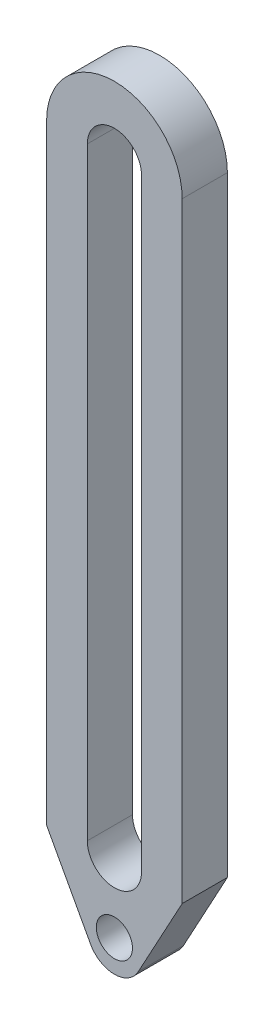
ISO-10303-21;
HEADER;
FILE_DESCRIPTION(('STEP AP214'),'2;1');
FILE_NAME('part.step','',(''),(''),'','','');
FILE_SCHEMA(('AUTOMOTIVE_DESIGN { 1 0 10303 214 1 1 1 1 }'));
ENDSEC;
DATA;
#1=APPLICATION_CONTEXT('core data for automotive mechanical design processes');
#2=APPLICATION_PROTOCOL_DEFINITION('international standard','automotive_design',2000,#1);
#3=PRODUCT_CONTEXT('',#1,'mechanical');
#4=PRODUCT('Part','Part','',(#3));
#5=PRODUCT_RELATED_PRODUCT_CATEGORY('part','',(#4));
#6=PRODUCT_DEFINITION_FORMATION('','',#4);
#7=PRODUCT_DEFINITION_CONTEXT('part definition',#1,'design');
#8=PRODUCT_DEFINITION('design','',#6,#7);
#9=PRODUCT_DEFINITION_SHAPE('','',#8);
#10=(LENGTH_UNIT() NAMED_UNIT(*) SI_UNIT(.MILLI.,.METRE.));
#11=(NAMED_UNIT(*) PLANE_ANGLE_UNIT() SI_UNIT($,.RADIAN.));
#12=(NAMED_UNIT(*) SI_UNIT($,.STERADIAN.) SOLID_ANGLE_UNIT());
#13=UNCERTAINTY_MEASURE_WITH_UNIT(LENGTH_MEASURE(1.E-05),#10,'distance_accuracy_value','');
#14=(GEOMETRIC_REPRESENTATION_CONTEXT(3) GLOBAL_UNCERTAINTY_ASSIGNED_CONTEXT((#13)) GLOBAL_UNIT_ASSIGNED_CONTEXT((#10,
#11,#12)) REPRESENTATION_CONTEXT('',''));
#15=CARTESIAN_POINT('',(0.,0.,0.));
#16=DIRECTION('',(0.,0.,1.));
#17=DIRECTION('',(1.,0.,0.));
#18=AXIS2_PLACEMENT_3D('',#15,#16,#17);
#19=CARTESIAN_POINT('',(-9.09802711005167,-17.1856502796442,5.));
#20=DIRECTION('',(0.,0.,-1.));
#21=DIRECTION('',(-1.,0.,0.));
#22=AXIS2_PLACEMENT_3D('',#19,#20,#21);
#23=PLANE('',#22);
#24=DIRECTION('',(0.477072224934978,0.878864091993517,0.));
#25=VECTOR('',#24,1.);
#26=CARTESIAN_POINT('',(-1.59802711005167,-9.65748053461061,5.));
#27=LINE('',#26,#25);
#28=CARTESIAN_POINT('',(-6.46143483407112,-18.6168669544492,5.));
#29=VERTEX_POINT('',#28);
#30=CARTESIAN_POINT('',(-1.59802711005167,-9.65748053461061,5.));
#31=VERTEX_POINT('',#30);
#32=EDGE_CURVE('E150',#29,#31,#27,.T.);
#33=ORIENTED_EDGE('',*,*,#32,.T.);
#34=DIRECTION('',(0.,1.,0.));
#35=VECTOR('',#34,1.);
#36=CARTESIAN_POINT('',(-1.59802711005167,-9.65748053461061,5.));
#37=LINE('',#36,#35);
#38=CARTESIAN_POINT('',(-1.59802711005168,57.87571387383,5.));
#39=VERTEX_POINT('',#38);
#40=EDGE_CURVE('E153',#31,#39,#37,.T.);
#41=ORIENTED_EDGE('',*,*,#40,.T.);
#42=CARTESIAN_POINT('',(-9.09802711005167,57.87571387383,5.));
#43=DIRECTION('',(0.,0.,1.));
#44=DIRECTION('',(1.,0.,0.));
#45=AXIS2_PLACEMENT_3D('',#42,#43,#44);
#46=CIRCLE('',#45,7.5);
#47=CARTESIAN_POINT('',(-16.5980271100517,57.87571387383,5.));
#48=VERTEX_POINT('',#47);
#49=EDGE_CURVE('E156',#39,#48,#46,.T.);
#50=ORIENTED_EDGE('',*,*,#49,.T.);
#51=DIRECTION('',(0.,-1.,0.));
#52=VECTOR('',#51,1.);
#53=CARTESIAN_POINT('',(-16.5980271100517,57.87571387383,5.));
#54=LINE('',#53,#52);
#55=CARTESIAN_POINT('',(-16.5980271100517,-9.65748053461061,5.));
#56=VERTEX_POINT('',#55);
#57=EDGE_CURVE('E158',#48,#56,#54,.T.);
#58=ORIENTED_EDGE('',*,*,#57,.T.);
#59=DIRECTION('',(0.477072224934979,-0.878864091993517,0.));
#60=VECTOR('',#59,1.);
#61=CARTESIAN_POINT('',(-11.7346193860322,-18.6168669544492,5.));
#62=LINE('',#61,#60);
#63=CARTESIAN_POINT('',(-11.7346193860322,-18.6168669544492,5.));
#64=VERTEX_POINT('',#63);
#65=EDGE_CURVE('E160',#56,#64,#62,.T.);
#66=ORIENTED_EDGE('',*,*,#65,.T.);
#67=CARTESIAN_POINT('',(-9.09802711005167,-17.1856502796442,5.));
#68=DIRECTION('',(0.,0.,1.));
#69=DIRECTION('',(-1.,0.,0.));
#70=AXIS2_PLACEMENT_3D('',#67,#68,#69);
#71=CIRCLE('',#70,2.99999999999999);
#72=EDGE_CURVE('E162',#64,#29,#71,.T.);
#73=ORIENTED_EDGE('',*,*,#72,.T.);
#74=EDGE_LOOP('',(#33,#41,#50,#58,#66,#73));
#75=FACE_BOUND('',#74,.T.);
#76=CARTESIAN_POINT('',(-9.09802711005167,-8.89337152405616,5.));
#77=DIRECTION('',(0.,0.,1.));
#78=DIRECTION('',(1.,0.,0.));
#79=AXIS2_PLACEMENT_3D('',#76,#77,#78);
#80=CIRCLE('',#79,3.);
#81=CARTESIAN_POINT('',(-12.0980271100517,-8.89337152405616,5.));
#82=VERTEX_POINT('',#81);
#83=CARTESIAN_POINT('',(-6.09802711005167,-8.89337152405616,5.));
#84=VERTEX_POINT('',#83);
#85=EDGE_CURVE('E111',#82,#84,#80,.T.);
#86=ORIENTED_EDGE('',*,*,#85,.F.);
#87=DIRECTION('',(0.,-1.,0.));
#88=VECTOR('',#87,1.);
#89=CARTESIAN_POINT('',(-12.0980271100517,57.87571387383,5.));
#90=LINE('',#89,#88);
#91=CARTESIAN_POINT('',(-12.0980271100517,57.87571387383,5.));
#92=VERTEX_POINT('',#91);
#93=EDGE_CURVE('E134',#92,#82,#90,.T.);
#94=ORIENTED_EDGE('',*,*,#93,.F.);
#95=CARTESIAN_POINT('',(-9.09802711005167,57.87571387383,5.));
#96=DIRECTION('',(0.,0.,1.));
#97=DIRECTION('',(1.,0.,0.));
#98=AXIS2_PLACEMENT_3D('',#95,#96,#97);
#99=CIRCLE('',#98,3.00000000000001);
#100=CARTESIAN_POINT('',(-6.09802711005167,57.87571387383,5.));
#101=VERTEX_POINT('',#100);
#102=EDGE_CURVE('E132',#101,#92,#99,.T.);
#103=ORIENTED_EDGE('',*,*,#102,.F.);
#104=DIRECTION('',(0.,1.,0.));
#105=VECTOR('',#104,1.);
#106=CARTESIAN_POINT('',(-6.09802711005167,-8.89337152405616,5.));
#107=LINE('',#106,#105);
#108=EDGE_CURVE('E119',#84,#101,#107,.T.);
#109=ORIENTED_EDGE('',*,*,#108,.F.);
#110=EDGE_LOOP('',(#86,#94,#103,#109));
#111=FACE_BOUND('',#110,.T.);
#112=CARTESIAN_POINT('',(-9.09802711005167,-16.6856502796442,5.));
#113=DIRECTION('',(0.,0.,1.));
#114=DIRECTION('',(1.,0.,0.));
#115=AXIS2_PLACEMENT_3D('',#112,#113,#114);
#116=CIRCLE('',#115,2.);
#117=CARTESIAN_POINT('',(-7.09802711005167,-16.6856502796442,5.));
#118=VERTEX_POINT('',#117);
#119=EDGE_CURVE('E140',#118,#118,#116,.T.);
#120=ORIENTED_EDGE('',*,*,#119,.F.);
#121=EDGE_LOOP('',(#120));
#122=FACE_BOUND('',#121,.T.);
#123=ADVANCED_FACE('F34',(#75,#111,#122),#23,.F.);
#124=CARTESIAN_POINT('',(-9.09802711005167,-17.1856502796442,0.));
#125=DIRECTION('',(0.,0.,-1.));
#126=DIRECTION('',(-1.,0.,0.));
#127=AXIS2_PLACEMENT_3D('',#124,#125,#126);
#128=PLANE('',#127);
#129=DIRECTION('',(0.,-1.,0.));
#130=VECTOR('',#129,1.);
#131=CARTESIAN_POINT('',(-12.0980271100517,57.87571387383,0.));
#132=LINE('',#131,#130);
#133=CARTESIAN_POINT('',(-12.0980271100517,57.87571387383,0.));
#134=VERTEX_POINT('',#133);
#135=CARTESIAN_POINT('',(-12.0980271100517,-8.89337152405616,0.));
#136=VERTEX_POINT('',#135);
#137=EDGE_CURVE('E120',#134,#136,#132,.T.);
#138=ORIENTED_EDGE('',*,*,#137,.T.);
#139=CARTESIAN_POINT('',(-9.09802711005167,-8.89337152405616,0.));
#140=DIRECTION('',(0.,0.,1.));
#141=DIRECTION('',(1.,0.,0.));
#142=AXIS2_PLACEMENT_3D('',#139,#140,#141);
#143=CIRCLE('',#142,3.);
#144=CARTESIAN_POINT('',(-6.09802711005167,-8.89337152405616,0.));
#145=VERTEX_POINT('',#144);
#146=EDGE_CURVE('E57',#136,#145,#143,.T.);
#147=ORIENTED_EDGE('',*,*,#146,.T.);
#148=DIRECTION('',(0.,1.,0.));
#149=VECTOR('',#148,1.);
#150=CARTESIAN_POINT('',(-6.09802711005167,-8.89337152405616,0.));
#151=LINE('',#150,#149);
#152=CARTESIAN_POINT('',(-6.09802711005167,57.87571387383,0.));
#153=VERTEX_POINT('',#152);
#154=EDGE_CURVE('E126',#145,#153,#151,.T.);
#155=ORIENTED_EDGE('',*,*,#154,.T.);
#156=CARTESIAN_POINT('',(-9.09802711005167,57.87571387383,0.));
#157=DIRECTION('',(0.,0.,1.));
#158=DIRECTION('',(1.,0.,0.));
#159=AXIS2_PLACEMENT_3D('',#156,#157,#158);
#160=CIRCLE('',#159,3.00000000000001);
#161=EDGE_CURVE('E142',#153,#134,#160,.T.);
#162=ORIENTED_EDGE('',*,*,#161,.T.);
#163=EDGE_LOOP('',(#138,#147,#155,#162));
#164=FACE_BOUND('',#163,.T.);
#165=DIRECTION('',(0.477072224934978,0.878864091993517,0.));
#166=VECTOR('',#165,1.);
#167=CARTESIAN_POINT('',(-1.59802711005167,-9.65748053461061,0.));
#168=LINE('',#167,#166);
#169=CARTESIAN_POINT('',(-6.46143483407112,-18.6168669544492,0.));
#170=VERTEX_POINT('',#169);
#171=CARTESIAN_POINT('',(-1.59802711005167,-9.65748053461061,0.));
#172=VERTEX_POINT('',#171);
#173=EDGE_CURVE('E127',#170,#172,#168,.T.);
#174=ORIENTED_EDGE('',*,*,#173,.F.);
#175=CARTESIAN_POINT('',(-9.09802711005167,-17.1856502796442,0.));
#176=DIRECTION('',(0.,0.,1.));
#177=DIRECTION('',(-1.,0.,0.));
#178=AXIS2_PLACEMENT_3D('',#175,#176,#177);
#179=CIRCLE('',#178,2.99999999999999);
#180=CARTESIAN_POINT('',(-11.7346193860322,-18.6168669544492,0.));
#181=VERTEX_POINT('',#180);
#182=EDGE_CURVE('E154',#181,#170,#179,.T.);
#183=ORIENTED_EDGE('',*,*,#182,.F.);
#184=DIRECTION('',(0.477072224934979,-0.878864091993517,0.));
#185=VECTOR('',#184,1.);
#186=CARTESIAN_POINT('',(-11.7346193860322,-18.6168669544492,0.));
#187=LINE('',#186,#185);
#188=CARTESIAN_POINT('',(-16.5980271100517,-9.65748053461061,0.));
#189=VERTEX_POINT('',#188);
#190=EDGE_CURVE('E173',#189,#181,#187,.T.);
#191=ORIENTED_EDGE('',*,*,#190,.F.);
#192=DIRECTION('',(0.,-1.,0.));
#193=VECTOR('',#192,1.);
#194=CARTESIAN_POINT('',(-16.5980271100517,57.87571387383,0.));
#195=LINE('',#194,#193);
#196=CARTESIAN_POINT('',(-16.5980271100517,57.87571387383,0.));
#197=VERTEX_POINT('',#196);
#198=EDGE_CURVE('E171',#197,#189,#195,.T.);
#199=ORIENTED_EDGE('',*,*,#198,.F.);
#200=CARTESIAN_POINT('',(-9.09802711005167,57.87571387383,0.));
#201=DIRECTION('',(0.,0.,1.));
#202=DIRECTION('',(1.,0.,0.));
#203=AXIS2_PLACEMENT_3D('',#200,#201,#202);
#204=CIRCLE('',#203,7.5);
#205=CARTESIAN_POINT('',(-1.59802711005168,57.87571387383,0.));
#206=VERTEX_POINT('',#205);
#207=EDGE_CURVE('E169',#206,#197,#204,.T.);
#208=ORIENTED_EDGE('',*,*,#207,.F.);
#209=DIRECTION('',(0.,1.,0.));
#210=VECTOR('',#209,1.);
#211=CARTESIAN_POINT('',(-1.59802711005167,-9.65748053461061,0.));
#212=LINE('',#211,#210);
#213=EDGE_CURVE('E167',#172,#206,#212,.T.);
#214=ORIENTED_EDGE('',*,*,#213,.F.);
#215=EDGE_LOOP('',(#174,#183,#191,#199,#208,#214));
#216=FACE_BOUND('',#215,.T.);
#217=CARTESIAN_POINT('',(-9.09802711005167,-16.6856502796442,0.));
#218=DIRECTION('',(0.,0.,1.));
#219=DIRECTION('',(1.,0.,0.));
#220=AXIS2_PLACEMENT_3D('',#217,#218,#219);
#221=CIRCLE('',#220,2.);
#222=CARTESIAN_POINT('',(-7.09802711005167,-16.6856502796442,0.));
#223=VERTEX_POINT('',#222);
#224=EDGE_CURVE('E253',#223,#223,#221,.T.);
#225=ORIENTED_EDGE('',*,*,#224,.T.);
#226=EDGE_LOOP('',(#225));
#227=FACE_BOUND('',#226,.T.);
#228=ADVANCED_FACE('F197',(#164,#216,#227),#128,.T.);
#229=CARTESIAN_POINT('',(-1.59802711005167,-9.65748053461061,5.));
#230=DIRECTION('',(-0.878864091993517,0.477072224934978,0.));
#231=DIRECTION('',(-0.477072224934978,-0.878864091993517,0.));
#232=AXIS2_PLACEMENT_3D('',#229,#230,#231);
#233=PLANE('',#232);
#234=ORIENTED_EDGE('',*,*,#173,.T.);
#235=DIRECTION('',(0.,0.,-1.));
#236=VECTOR('',#235,1.);
#237=CARTESIAN_POINT('',(-1.59802711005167,-9.65748053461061,5.));
#238=LINE('',#237,#236);
#239=EDGE_CURVE('E11',#31,#172,#238,.T.);
#240=ORIENTED_EDGE('',*,*,#239,.F.);
#241=ORIENTED_EDGE('',*,*,#32,.F.);
#242=DIRECTION('',(0.,0.,-1.));
#243=VECTOR('',#242,1.);
#244=CARTESIAN_POINT('',(-6.46143483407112,-18.6168669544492,5.));
#245=LINE('',#244,#243);
#246=EDGE_CURVE('E164',#29,#170,#245,.T.);
#247=ORIENTED_EDGE('',*,*,#246,.T.);
#248=EDGE_LOOP('',(#234,#240,#241,#247));
#249=FACE_BOUND('',#248,.T.);
#250=ADVANCED_FACE('F36',(#249),#233,.F.);
#251=CARTESIAN_POINT('',(-1.59802711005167,-9.65748053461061,5.));
#252=DIRECTION('',(-1.,0.,0.));
#253=DIRECTION('',(0.,-1.,0.));
#254=AXIS2_PLACEMENT_3D('',#251,#252,#253);
#255=PLANE('',#254);
#256=ORIENTED_EDGE('',*,*,#213,.T.);
#257=DIRECTION('',(0.,0.,-1.));
#258=VECTOR('',#257,1.);
#259=CARTESIAN_POINT('',(-1.59802711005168,57.87571387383,5.));
#260=LINE('',#259,#258);
#261=EDGE_CURVE('E42',#39,#206,#260,.T.);
#262=ORIENTED_EDGE('',*,*,#261,.F.);
#263=ORIENTED_EDGE('',*,*,#40,.F.);
#264=ORIENTED_EDGE('',*,*,#239,.T.);
#265=EDGE_LOOP('',(#256,#262,#263,#264));
#266=FACE_BOUND('',#265,.T.);
#267=ADVANCED_FACE('F214',(#266),#255,.F.);
#268=CARTESIAN_POINT('',(-9.09802711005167,57.87571387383,5.));
#269=DIRECTION('',(0.,0.,-1.));
#270=DIRECTION('',(-1.,0.,0.));
#271=AXIS2_PLACEMENT_3D('',#268,#269,#270);
#272=CYLINDRICAL_SURFACE('',#271,7.5);
#273=ORIENTED_EDGE('',*,*,#207,.T.);
#274=DIRECTION('',(0.,0.,-1.));
#275=VECTOR('',#274,1.);
#276=CARTESIAN_POINT('',(-16.5980271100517,57.87571387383,5.));
#277=LINE('',#276,#275);
#278=EDGE_CURVE('E184',#48,#197,#277,.T.);
#279=ORIENTED_EDGE('',*,*,#278,.F.);
#280=ORIENTED_EDGE('',*,*,#49,.F.);
#281=ORIENTED_EDGE('',*,*,#261,.T.);
#282=EDGE_LOOP('',(#273,#279,#280,#281));
#283=FACE_BOUND('',#282,.T.);
#284=ADVANCED_FACE('F191',(#283),#272,.T.);
#285=CARTESIAN_POINT('',(-16.5980271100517,57.87571387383,5.));
#286=DIRECTION('',(1.,0.,0.));
#287=DIRECTION('',(0.,0.,-1.));
#288=AXIS2_PLACEMENT_3D('',#285,#286,#287);
#289=PLANE('',#288);
#290=ORIENTED_EDGE('',*,*,#198,.T.);
#291=DIRECTION('',(0.,0.,-1.));
#292=VECTOR('',#291,1.);
#293=CARTESIAN_POINT('',(-16.5980271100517,-9.65748053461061,5.));
#294=LINE('',#293,#292);
#295=EDGE_CURVE('E181',#56,#189,#294,.T.);
#296=ORIENTED_EDGE('',*,*,#295,.F.);
#297=ORIENTED_EDGE('',*,*,#57,.F.);
#298=ORIENTED_EDGE('',*,*,#278,.T.);
#299=EDGE_LOOP('',(#290,#296,#297,#298));
#300=FACE_BOUND('',#299,.T.);
#301=ADVANCED_FACE('F203',(#300),#289,.F.);
#302=CARTESIAN_POINT('',(-11.7346193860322,-18.6168669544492,5.));
#303=DIRECTION('',(0.878864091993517,0.477072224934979,0.));
#304=DIRECTION('',(-0.477072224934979,0.878864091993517,0.));
#305=AXIS2_PLACEMENT_3D('',#302,#303,#304);
#306=PLANE('',#305);
#307=ORIENTED_EDGE('',*,*,#190,.T.);
#308=DIRECTION('',(0.,0.,-1.));
#309=VECTOR('',#308,1.);
#310=CARTESIAN_POINT('',(-11.7346193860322,-18.6168669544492,5.));
#311=LINE('',#310,#309);
#312=EDGE_CURVE('E178',#64,#181,#311,.T.);
#313=ORIENTED_EDGE('',*,*,#312,.F.);
#314=ORIENTED_EDGE('',*,*,#65,.F.);
#315=ORIENTED_EDGE('',*,*,#295,.T.);
#316=EDGE_LOOP('',(#307,#313,#314,#315));
#317=FACE_BOUND('',#316,.T.);
#318=ADVANCED_FACE('F207',(#317),#306,.F.);
#319=CARTESIAN_POINT('',(-9.09802711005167,-17.1856502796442,5.));
#320=DIRECTION('',(0.,0.,-1.));
#321=DIRECTION('',(-1.,0.,0.));
#322=AXIS2_PLACEMENT_3D('',#319,#320,#321);
#323=CYLINDRICAL_SURFACE('',#322,2.99999999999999);
#324=ORIENTED_EDGE('',*,*,#182,.T.);
#325=ORIENTED_EDGE('',*,*,#246,.F.);
#326=ORIENTED_EDGE('',*,*,#72,.F.);
#327=ORIENTED_EDGE('',*,*,#312,.T.);
#328=EDGE_LOOP('',(#324,#325,#326,#327));
#329=FACE_BOUND('',#328,.T.);
#330=ADVANCED_FACE('F217',(#329),#323,.T.);
#331=CARTESIAN_POINT('',(-9.09802711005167,-8.89337152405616,5.));
#332=DIRECTION('',(0.,0.,-1.));
#333=DIRECTION('',(-1.,0.,0.));
#334=AXIS2_PLACEMENT_3D('',#331,#332,#333);
#335=CYLINDRICAL_SURFACE('',#334,3.);
#336=ORIENTED_EDGE('',*,*,#146,.F.);
#337=DIRECTION('',(0.,0.,-1.));
#338=VECTOR('',#337,1.);
#339=CARTESIAN_POINT('',(-12.0980271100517,-8.89337152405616,5.));
#340=LINE('',#339,#338);
#341=EDGE_CURVE('E115',#82,#136,#340,.T.);
#342=ORIENTED_EDGE('',*,*,#341,.F.);
#343=ORIENTED_EDGE('',*,*,#85,.T.);
#344=DIRECTION('',(0.,0.,-1.));
#345=VECTOR('',#344,1.);
#346=CARTESIAN_POINT('',(-6.09802711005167,-8.89337152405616,5.));
#347=LINE('',#346,#345);
#348=EDGE_CURVE('E114',#84,#145,#347,.T.);
#349=ORIENTED_EDGE('',*,*,#348,.T.);
#350=EDGE_LOOP('',(#336,#342,#343,#349));
#351=FACE_BOUND('',#350,.T.);
#352=ADVANCED_FACE('F113',(#351),#335,.F.);
#353=CARTESIAN_POINT('',(-6.09802711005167,-8.89337152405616,5.));
#354=DIRECTION('',(-1.,0.,0.));
#355=DIRECTION('',(0.,-1.,0.));
#356=AXIS2_PLACEMENT_3D('',#353,#354,#355);
#357=PLANE('',#356);
#358=ORIENTED_EDGE('',*,*,#154,.F.);
#359=ORIENTED_EDGE('',*,*,#348,.F.);
#360=ORIENTED_EDGE('',*,*,#108,.T.);
#361=DIRECTION('',(0.,0.,-1.));
#362=VECTOR('',#361,1.);
#363=CARTESIAN_POINT('',(-6.09802711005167,57.87571387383,5.));
#364=LINE('',#363,#362);
#365=EDGE_CURVE('E128',#101,#153,#364,.T.);
#366=ORIENTED_EDGE('',*,*,#365,.T.);
#367=EDGE_LOOP('',(#358,#359,#360,#366));
#368=FACE_BOUND('',#367,.T.);
#369=ADVANCED_FACE('F123',(#368),#357,.T.);
#370=CARTESIAN_POINT('',(-9.09802711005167,57.87571387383,5.));
#371=DIRECTION('',(0.,0.,-1.));
#372=DIRECTION('',(-1.,0.,0.));
#373=AXIS2_PLACEMENT_3D('',#370,#371,#372);
#374=CYLINDRICAL_SURFACE('',#373,3.00000000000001);
#375=ORIENTED_EDGE('',*,*,#161,.F.);
#376=ORIENTED_EDGE('',*,*,#365,.F.);
#377=ORIENTED_EDGE('',*,*,#102,.T.);
#378=DIRECTION('',(0.,0.,-1.));
#379=VECTOR('',#378,1.);
#380=CARTESIAN_POINT('',(-12.0980271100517,57.87571387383,5.));
#381=LINE('',#380,#379);
#382=EDGE_CURVE('E49',#92,#134,#381,.T.);
#383=ORIENTED_EDGE('',*,*,#382,.T.);
#384=EDGE_LOOP('',(#375,#376,#377,#383));
#385=FACE_BOUND('',#384,.T.);
#386=ADVANCED_FACE('F236',(#385),#374,.F.);
#387=CARTESIAN_POINT('',(-12.0980271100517,57.87571387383,5.));
#388=DIRECTION('',(1.,0.,0.));
#389=DIRECTION('',(0.,1.,0.));
#390=AXIS2_PLACEMENT_3D('',#387,#388,#389);
#391=PLANE('',#390);
#392=ORIENTED_EDGE('',*,*,#137,.F.);
#393=ORIENTED_EDGE('',*,*,#382,.F.);
#394=ORIENTED_EDGE('',*,*,#93,.T.);
#395=ORIENTED_EDGE('',*,*,#341,.T.);
#396=EDGE_LOOP('',(#392,#393,#394,#395));
#397=FACE_BOUND('',#396,.T.);
#398=ADVANCED_FACE('F239',(#397),#391,.T.);
#399=CARTESIAN_POINT('',(-9.09802711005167,-16.6856502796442,5.));
#400=DIRECTION('',(0.,0.,-1.));
#401=DIRECTION('',(-1.,0.,0.));
#402=AXIS2_PLACEMENT_3D('',#399,#400,#401);
#403=CYLINDRICAL_SURFACE('',#402,2.);
#404=ORIENTED_EDGE('',*,*,#119,.T.);
#405=EDGE_LOOP('',(#404));
#406=FACE_BOUND('',#405,.T.);
#407=ORIENTED_EDGE('',*,*,#224,.F.);
#408=EDGE_LOOP('',(#407));
#409=FACE_BOUND('',#408,.T.);
#410=ADVANCED_FACE('F243',(#406,#409),#403,.F.);
#411=CLOSED_SHELL('',(#123,#228,#250,#267,#284,#301,#318,#330,#352,#369,#386,#398,#410));
#412=MANIFOLD_SOLID_BREP('B2',#411);
#413=ADVANCED_BREP_SHAPE_REPRESENTATION('',(#18,#412),#14);
#414=SHAPE_DEFINITION_REPRESENTATION(#9,#413);
ENDSEC;
END-ISO-10303-21;
